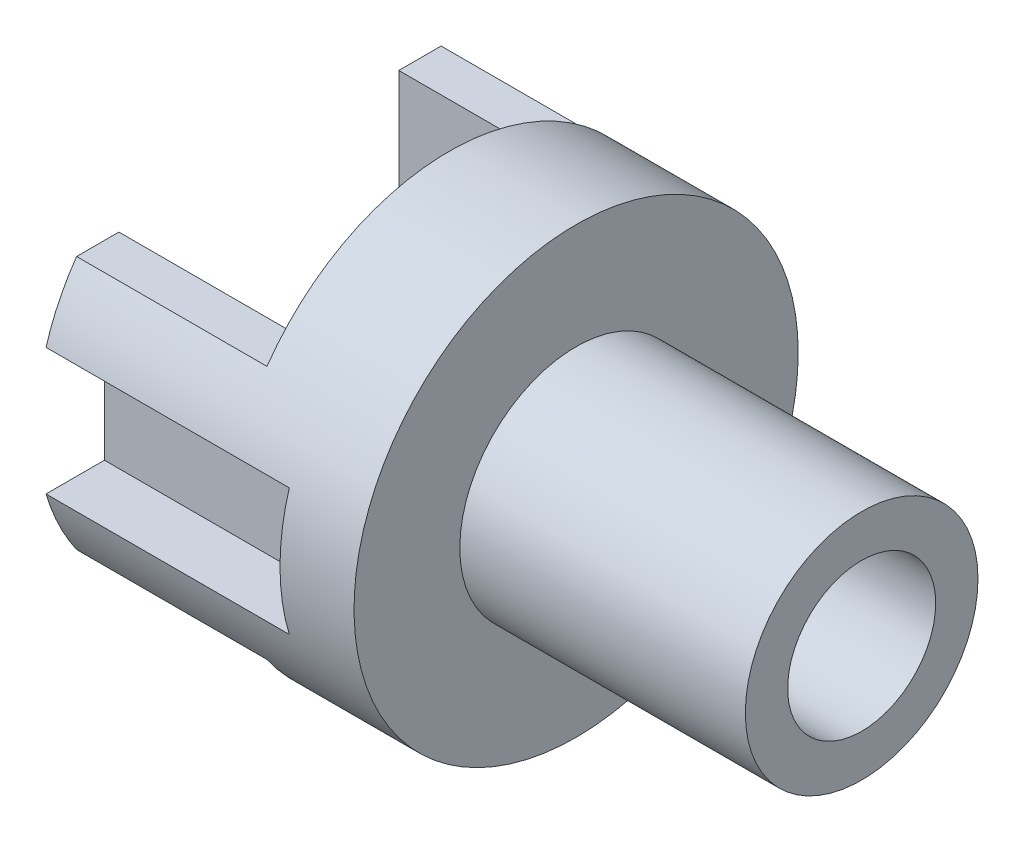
from build123d import *

# Parameters (mm, degrees)
SKETCH_1_R          = 84
EXTRUDE_1_DEPTH     = 120
CUT_EXTRUDE_1_DEPTH = 72
CUT_EXTRUDE_2_DEPTH = 92
SKETCH_3_R          = 44
EXTRUDE_2_DEPTH     = 108
SKETCH_4_R          = 28
CUT_EXTRUDE_3_DEPTH = 258.091423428


with BuildPart() as part:
    # Sketch 1 → Extrude 1 (new body)
    with BuildSketch(Plane(origin=(0, 0, 0), x_dir=(0, 0, -1), z_dir=(1, 0, 0))):
        Circle(SKETCH_1_R)
    extrude(amount=EXTRUDE_1_DEPTH)

    # Sketch 2 → Cut-Extrude 1 (cut)
    with BuildSketch(Plane.ZY):
        with BuildLine():
            ThreePointArc((68.934751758, 48), (0, 84), (-68.934751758, 48))
            Line((-68.934751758, 48), (-52.934751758, 48))
            Line((-52.934751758, 48), (-52.934751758, -48))
            Line((-52.934751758, -48), (-68.934751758, -48))
            ThreePointArc((-68.934751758, -48), (0, -84), (68.934751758, -48))
            Line((68.934751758, -48), (52.934751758, -48))
            Line((52.934751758, -48), (52.934751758, 48))
            Line((52.934751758, 48), (68.934751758, 48))
        make_face()
    extrude(amount=-CUT_EXTRUDE_1_DEPTH, mode=Mode.SUBTRACT)

    # Sketch 2_3 → Cut-Extrude 2 (cut)
    with BuildSketch(Plane.ZY):
        with BuildLine():
            Line((-59.84496124, 24), (-80.49844719, 24))
            ThreePointArc((-80.49844719, 24), (-84, 0), (-80.49844719, -24))
            Line((-80.49844719, -24), (-59.84496124, -24))
            Line((-59.84496124, -24), (-59.84496124, 24))
        make_face()
        with BuildLine():
            ThreePointArc((80.49844719, -24), (84, 0), (80.49844719, 24))
            Line((80.49844719, 24), (58.402182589, 24))
            Line((58.402182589, 24), (58.402182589, -24))
            Line((58.402182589, -24), (80.49844719, -24))
        make_face()
    extrude(amount=-CUT_EXTRUDE_2_DEPTH, mode=Mode.SUBTRACT)

    # Sketch 3 → Extrude 2 (add)
    with BuildSketch(Plane(origin=(120, 0, 0), x_dir=(0, 0, -1), z_dir=(1, 0, 0))):
        Circle(SKETCH_3_R)
    extrude(amount=EXTRUDE_2_DEPTH)

    # Sketch 4 → Cut-Extrude 3 (cut, through all)
    with BuildSketch(Plane(origin=(228, 0, 0), x_dir=(0, 0, -1), z_dir=(1, 0, 0))):
        Circle(SKETCH_4_R)
    extrude(amount=-CUT_EXTRUDE_3_DEPTH, mode=Mode.SUBTRACT)


solid = part.part
